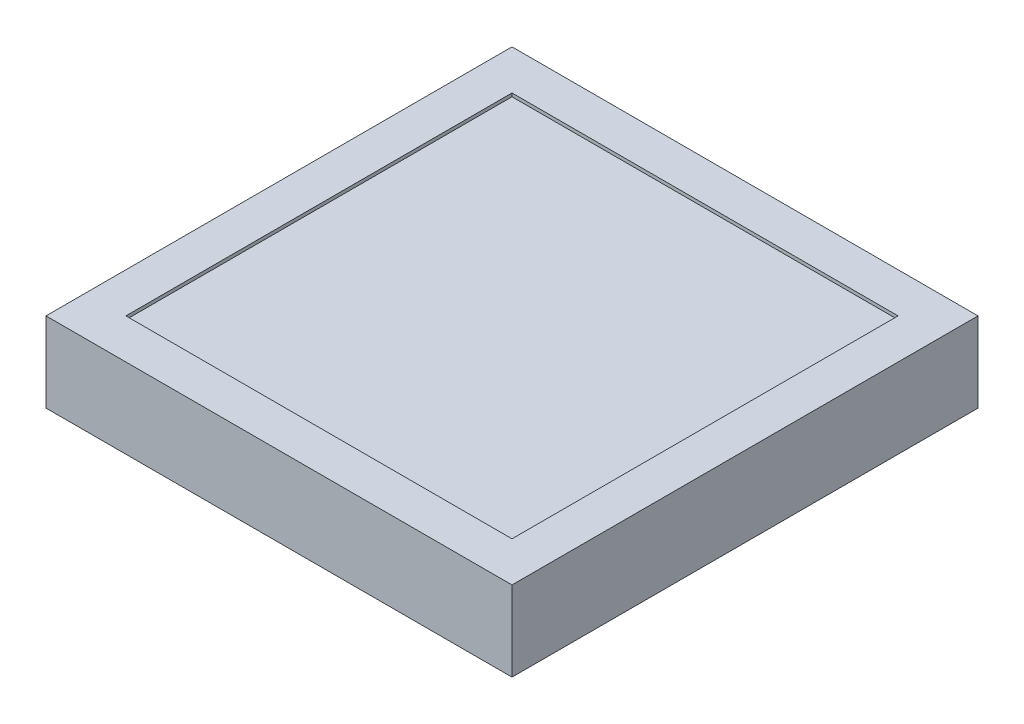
from build123d import *

# Parameters (mm, degrees)
CROQUIS1_W              = 140
CROQUIS1_H              = 140
SALIENTE_EXTRUIR1_DEPTH = 24
CROQUIS3_W              = 116
CROQUIS3_H              = 116
CORTAR_EXTRUIR2_DEPTH   = 1


with BuildPart() as part:
    # Croquis1 → Saliente-Extruir1 (new body)
    with BuildSketch(Plane(origin=(0, 0, 0), x_dir=(1, 0, 0), z_dir=(0, 1, 0))):
        with Locations((74.143471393, -75.254894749)):
            Rectangle(CROQUIS1_W, CROQUIS1_H)
    extrude(amount=SALIENTE_EXTRUIR1_DEPTH)

    # Croquis3 → Cortar-Extruir2 (cut)
    with BuildSketch(Plane(origin=(0, 24, 0), x_dir=(1, 0, 0), z_dir=(0, 1, 0))):
        with Locations((74.143471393, -75.254894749)):
            Rectangle(CROQUIS3_W, CROQUIS3_H)
    extrude(amount=-CORTAR_EXTRUIR2_DEPTH, mode=Mode.SUBTRACT)


solid = part.part
